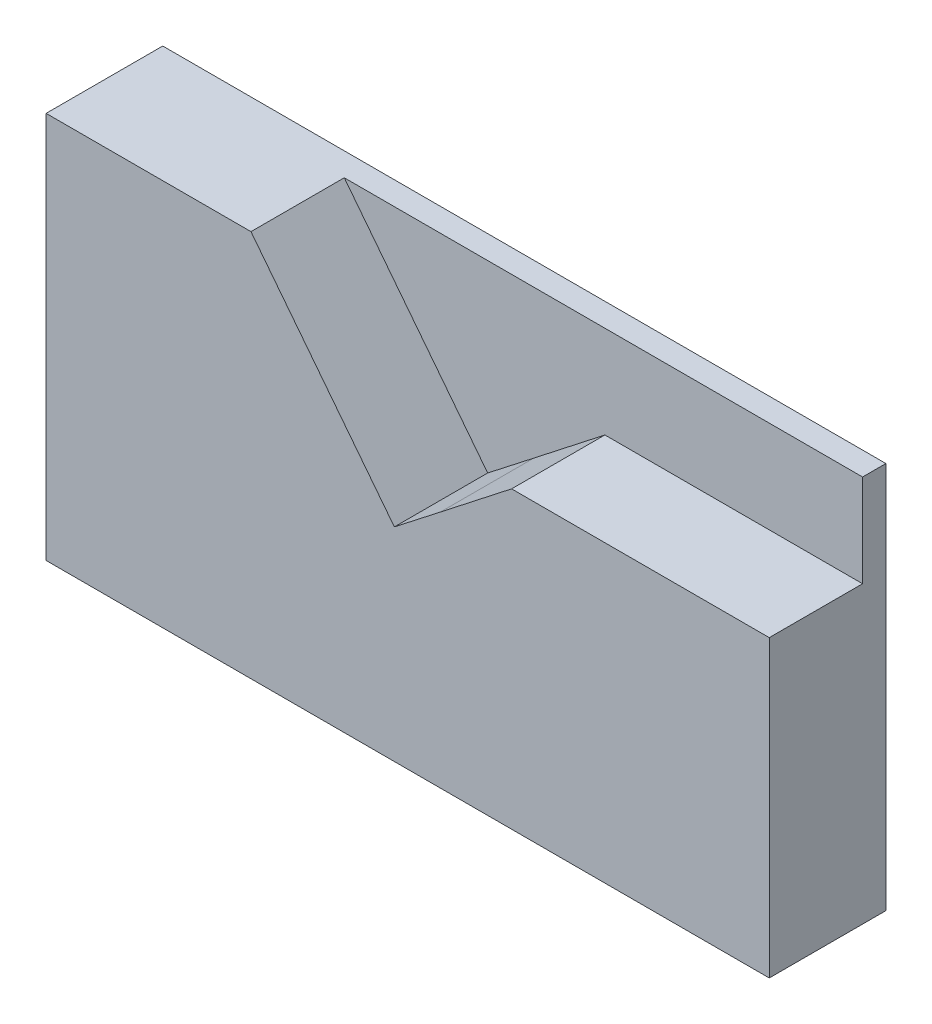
ISO-10303-21;
HEADER;
FILE_DESCRIPTION(('STEP AP214'),'2;1');
FILE_NAME('part.step','',(''),(''),'','','');
FILE_SCHEMA(('AUTOMOTIVE_DESIGN { 1 0 10303 214 1 1 1 1 }'));
ENDSEC;
DATA;
#1=APPLICATION_CONTEXT('core data for automotive mechanical design processes');
#2=APPLICATION_PROTOCOL_DEFINITION('international standard','automotive_design',2000,#1);
#3=PRODUCT_CONTEXT('',#1,'mechanical');
#4=PRODUCT('Part','Part','',(#3));
#5=PRODUCT_RELATED_PRODUCT_CATEGORY('part','',(#4));
#6=PRODUCT_DEFINITION_FORMATION('','',#4);
#7=PRODUCT_DEFINITION_CONTEXT('part definition',#1,'design');
#8=PRODUCT_DEFINITION('design','',#6,#7);
#9=PRODUCT_DEFINITION_SHAPE('','',#8);
#10=(LENGTH_UNIT() NAMED_UNIT(*) SI_UNIT(.MILLI.,.METRE.));
#11=(NAMED_UNIT(*) PLANE_ANGLE_UNIT() SI_UNIT($,.RADIAN.));
#12=(NAMED_UNIT(*) SI_UNIT($,.STERADIAN.) SOLID_ANGLE_UNIT());
#13=UNCERTAINTY_MEASURE_WITH_UNIT(LENGTH_MEASURE(1.E-05),#10,'distance_accuracy_value','');
#14=(GEOMETRIC_REPRESENTATION_CONTEXT(3) GLOBAL_UNCERTAINTY_ASSIGNED_CONTEXT((#13)) GLOBAL_UNIT_ASSIGNED_CONTEXT((#10,
#11,#12)) REPRESENTATION_CONTEXT('',''));
#15=CARTESIAN_POINT('',(0.,0.,0.));
#16=DIRECTION('',(0.,0.,1.));
#17=DIRECTION('',(1.,0.,0.));
#18=AXIS2_PLACEMENT_3D('',#15,#16,#17);
#19=CARTESIAN_POINT('',(0.,0.,6.35));
#20=DIRECTION('',(-1.,0.,0.));
#21=DIRECTION('',(0.,0.,1.));
#22=AXIS2_PLACEMENT_3D('',#19,#20,#21);
#23=PLANE('',#22);
#24=DIRECTION('',(0.,1.,0.));
#25=VECTOR('',#24,1.);
#26=CARTESIAN_POINT('',(0.,-44.6686440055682,1.27));
#27=LINE('',#26,#25);
#28=CARTESIAN_POINT('',(0.,16.048569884,1.27));
#29=VERTEX_POINT('',#28);
#30=CARTESIAN_POINT('',(0.,21.082,1.27));
#31=VERTEX_POINT('',#30);
#32=EDGE_CURVE('E132',#29,#31,#27,.T.);
#33=ORIENTED_EDGE('',*,*,#32,.F.);
#34=DIRECTION('',(0.,0.,1.));
#35=VECTOR('',#34,1.);
#36=CARTESIAN_POINT('',(0.,16.048569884,1.27));
#37=LINE('',#36,#35);
#38=CARTESIAN_POINT('',(0.,16.048569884,6.35));
#39=VERTEX_POINT('',#38);
#40=EDGE_CURVE('E109',#29,#39,#37,.T.);
#41=ORIENTED_EDGE('',*,*,#40,.T.);
#42=DIRECTION('',(0.,1.,0.));
#43=VECTOR('',#42,1.);
#44=CARTESIAN_POINT('',(0.,0.,6.35));
#45=LINE('',#44,#43);
#46=CARTESIAN_POINT('',(0.,0.,6.35));
#47=VERTEX_POINT('',#46);
#48=EDGE_CURVE('E119',#47,#39,#45,.T.);
#49=ORIENTED_EDGE('',*,*,#48,.F.);
#50=DIRECTION('',(0.,0.,-1.));
#51=VECTOR('',#50,1.);
#52=CARTESIAN_POINT('',(0.,0.,6.35));
#53=LINE('',#52,#51);
#54=CARTESIAN_POINT('',(0.,0.,0.));
#55=VERTEX_POINT('',#54);
#56=EDGE_CURVE('E160',#47,#55,#53,.T.);
#57=ORIENTED_EDGE('',*,*,#56,.T.);
#58=DIRECTION('',(0.,1.,0.));
#59=VECTOR('',#58,1.);
#60=CARTESIAN_POINT('',(0.,0.,0.));
#61=LINE('',#60,#59);
#62=CARTESIAN_POINT('',(0.,21.082,0.));
#63=VERTEX_POINT('',#62);
#64=EDGE_CURVE('E141',#55,#63,#61,.T.);
#65=ORIENTED_EDGE('',*,*,#64,.T.);
#66=DIRECTION('',(0.,0.,-1.));
#67=VECTOR('',#66,1.);
#68=CARTESIAN_POINT('',(0.,21.082,6.35));
#69=LINE('',#68,#67);
#70=EDGE_CURVE('E11',#31,#63,#69,.T.);
#71=ORIENTED_EDGE('',*,*,#70,.F.);
#72=EDGE_LOOP('',(#33,#41,#49,#57,#65,#71));
#73=FACE_BOUND('',#72,.T.);
#74=ADVANCED_FACE('F29',(#73),#23,.F.);
#75=CARTESIAN_POINT('',(0.,21.082,6.35));
#76=DIRECTION('',(0.,-1.,0.));
#77=DIRECTION('',(1.,0.,0.));
#78=AXIS2_PLACEMENT_3D('',#75,#76,#77);
#79=PLANE('',#78);
#80=DIRECTION('',(-1.,0.,0.));
#81=VECTOR('',#80,1.);
#82=CARTESIAN_POINT('',(0.,21.082,6.35));
#83=LINE('',#82,#81);
#84=CARTESIAN_POINT('',(-28.216693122,21.082,6.35));
#85=VERTEX_POINT('',#84);
#86=CARTESIAN_POINT('',(-39.37,21.082,6.35));
#87=VERTEX_POINT('',#86);
#88=EDGE_CURVE('E155',#85,#87,#83,.T.);
#89=ORIENTED_EDGE('',*,*,#88,.F.);
#90=DIRECTION('',(0.,0.,1.));
#91=VECTOR('',#90,1.);
#92=CARTESIAN_POINT('',(-28.216693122,21.082,1.27));
#93=LINE('',#92,#91);
#94=CARTESIAN_POINT('',(-28.216693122,21.082,1.27));
#95=VERTEX_POINT('',#94);
#96=EDGE_CURVE('E142',#95,#85,#93,.T.);
#97=ORIENTED_EDGE('',*,*,#96,.F.);
#98=DIRECTION('',(-1.,0.,0.));
#99=VECTOR('',#98,1.);
#100=CARTESIAN_POINT('',(-5.57665343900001,21.082,1.27));
#101=LINE('',#100,#99);
#102=EDGE_CURVE('E134',#31,#95,#101,.T.);
#103=ORIENTED_EDGE('',*,*,#102,.F.);
#104=ORIENTED_EDGE('',*,*,#70,.T.);
#105=DIRECTION('',(-1.,0.,0.));
#106=VECTOR('',#105,1.);
#107=CARTESIAN_POINT('',(0.,21.082,0.));
#108=LINE('',#107,#106);
#109=CARTESIAN_POINT('',(-39.37,21.082,0.));
#110=VERTEX_POINT('',#109);
#111=EDGE_CURVE('E148',#63,#110,#108,.T.);
#112=ORIENTED_EDGE('',*,*,#111,.T.);
#113=DIRECTION('',(0.,0.,-1.));
#114=VECTOR('',#113,1.);
#115=CARTESIAN_POINT('',(-39.37,21.082,6.35));
#116=LINE('',#115,#114);
#117=EDGE_CURVE('E36',#87,#110,#116,.T.);
#118=ORIENTED_EDGE('',*,*,#117,.F.);
#119=EDGE_LOOP('',(#89,#97,#103,#104,#112,#118));
#120=FACE_BOUND('',#119,.T.);
#121=ADVANCED_FACE('F193',(#120),#79,.F.);
#122=CARTESIAN_POINT('',(-39.37,0.,6.35));
#123=DIRECTION('',(1.,0.,0.));
#124=DIRECTION('',(0.,0.,-1.));
#125=AXIS2_PLACEMENT_3D('',#122,#123,#124);
#126=PLANE('',#125);
#127=DIRECTION('',(0.,-1.,0.));
#128=VECTOR('',#127,1.);
#129=CARTESIAN_POINT('',(-39.37,0.,0.));
#130=LINE('',#129,#128);
#131=CARTESIAN_POINT('',(-39.37,0.,0.));
#132=VERTEX_POINT('',#131);
#133=EDGE_CURVE('E150',#110,#132,#130,.T.);
#134=ORIENTED_EDGE('',*,*,#133,.T.);
#135=DIRECTION('',(0.,0.,-1.));
#136=VECTOR('',#135,1.);
#137=CARTESIAN_POINT('',(-39.37,0.,6.35));
#138=LINE('',#137,#136);
#139=CARTESIAN_POINT('',(-39.37,0.,6.35));
#140=VERTEX_POINT('',#139);
#141=EDGE_CURVE('E163',#140,#132,#138,.T.);
#142=ORIENTED_EDGE('',*,*,#141,.F.);
#143=DIRECTION('',(0.,-1.,0.));
#144=VECTOR('',#143,1.);
#145=CARTESIAN_POINT('',(-39.37,0.,6.35));
#146=LINE('',#145,#144);
#147=EDGE_CURVE('E157',#87,#140,#146,.T.);
#148=ORIENTED_EDGE('',*,*,#147,.F.);
#149=ORIENTED_EDGE('',*,*,#117,.T.);
#150=EDGE_LOOP('',(#134,#142,#148,#149));
#151=FACE_BOUND('',#150,.T.);
#152=ADVANCED_FACE('F170',(#151),#126,.F.);
#153=CARTESIAN_POINT('',(0.,0.,6.35));
#154=DIRECTION('',(0.,1.,0.));
#155=DIRECTION('',(-1.,0.,0.));
#156=AXIS2_PLACEMENT_3D('',#153,#154,#155);
#157=PLANE('',#156);
#158=DIRECTION('',(1.,0.,0.));
#159=VECTOR('',#158,1.);
#160=CARTESIAN_POINT('',(0.,0.,0.));
#161=LINE('',#160,#159);
#162=EDGE_CURVE('E152',#132,#55,#161,.T.);
#163=ORIENTED_EDGE('',*,*,#162,.T.);
#164=ORIENTED_EDGE('',*,*,#56,.F.);
#165=DIRECTION('',(1.,0.,0.));
#166=VECTOR('',#165,1.);
#167=CARTESIAN_POINT('',(0.,0.,6.35));
#168=LINE('',#167,#166);
#169=EDGE_CURVE('E51',#140,#47,#168,.T.);
#170=ORIENTED_EDGE('',*,*,#169,.F.);
#171=ORIENTED_EDGE('',*,*,#141,.T.);
#172=EDGE_LOOP('',(#163,#164,#170,#171));
#173=FACE_BOUND('',#172,.T.);
#174=ADVANCED_FACE('F180',(#173),#157,.F.);
#175=CARTESIAN_POINT('',(0.,0.,6.35));
#176=DIRECTION('',(0.,0.,1.));
#177=DIRECTION('',(1.,0.,0.));
#178=AXIS2_PLACEMENT_3D('',#175,#176,#177);
#179=PLANE('',#178);
#180=DIRECTION('',(0.614667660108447,-0.788786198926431,0.));
#181=VECTOR('',#180,1.);
#182=CARTESIAN_POINT('',(12.2157157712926,-30.8038046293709,6.35));
#183=LINE('',#182,#181);
#184=CARTESIAN_POINT('',(-20.4104138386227,11.0644152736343,6.35));
#185=VERTEX_POINT('',#184);
#186=EDGE_CURVE('E120',#85,#185,#183,.T.);
#187=ORIENTED_EDGE('',*,*,#186,.F.);
#188=ORIENTED_EDGE('',*,*,#88,.T.);
#189=ORIENTED_EDGE('',*,*,#147,.T.);
#190=ORIENTED_EDGE('',*,*,#169,.T.);
#191=ORIENTED_EDGE('',*,*,#48,.T.);
#192=DIRECTION('',(1.,0.,0.));
#193=VECTOR('',#192,1.);
#194=CARTESIAN_POINT('',(-5.576653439,16.048569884,6.35));
#195=LINE('',#194,#193);
#196=CARTESIAN_POINT('',(-14.027760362,16.048569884,6.35));
#197=VERTEX_POINT('',#196);
#198=EDGE_CURVE('E102',#197,#39,#195,.T.);
#199=ORIENTED_EDGE('',*,*,#198,.F.);
#200=DIRECTION('',(0.787758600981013,0.615984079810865,0.));
#201=VECTOR('',#200,1.);
#202=CARTESIAN_POINT('',(-38.2461420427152,-2.88887813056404,6.35));
#203=LINE('',#202,#201);
#204=CARTESIAN_POINT('',(-17.9060176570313,13.0159850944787,6.35));
#205=VERTEX_POINT('',#204);
#206=EDGE_CURVE('E113',#205,#197,#203,.T.);
#207=ORIENTED_EDGE('',*,*,#206,.F.);
#208=DIRECTION('',(0.788786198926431,0.614667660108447,0.));
#209=VECTOR('',#208,1.);
#210=CARTESIAN_POINT('',(-38.2027830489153,-2.80042410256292,6.35));
#211=LINE('',#210,#209);
#212=EDGE_CURVE('E43',#185,#205,#211,.T.);
#213=ORIENTED_EDGE('',*,*,#212,.F.);
#214=EDGE_LOOP('',(#187,#188,#189,#190,#191,#199,#207,#213));
#215=FACE_BOUND('',#214,.T.);
#216=ADVANCED_FACE('F117',(#215),#179,.T.);
#217=CARTESIAN_POINT('',(0.,0.,0.));
#218=DIRECTION('',(0.,0.,1.));
#219=DIRECTION('',(1.,0.,0.));
#220=AXIS2_PLACEMENT_3D('',#217,#218,#219);
#221=PLANE('',#220);
#222=ORIENTED_EDGE('',*,*,#64,.F.);
#223=ORIENTED_EDGE('',*,*,#162,.F.);
#224=ORIENTED_EDGE('',*,*,#133,.F.);
#225=ORIENTED_EDGE('',*,*,#111,.F.);
#226=EDGE_LOOP('',(#222,#223,#224,#225));
#227=FACE_BOUND('',#226,.T.);
#228=ADVANCED_FACE('F178',(#227),#221,.F.);
#229=CARTESIAN_POINT('',(-38.2027830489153,-2.80042410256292,1.27));
#230=DIRECTION('',(0.614667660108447,-0.78878619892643,0.));
#231=DIRECTION('',(0.788786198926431,0.614667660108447,0.));
#232=AXIS2_PLACEMENT_3D('',#229,#230,#231);
#233=PLANE('',#232);
#234=ORIENTED_EDGE('',*,*,#212,.T.);
#235=DIRECTION('',(0.,0.,1.));
#236=VECTOR('',#235,1.);
#237=CARTESIAN_POINT('',(-17.9060176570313,13.0159850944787,1.27));
#238=LINE('',#237,#236);
#239=CARTESIAN_POINT('',(-17.9060176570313,13.0159850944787,1.27));
#240=VERTEX_POINT('',#239);
#241=EDGE_CURVE('E110',#240,#205,#238,.T.);
#242=ORIENTED_EDGE('',*,*,#241,.F.);
#243=DIRECTION('',(0.788786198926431,0.614667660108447,0.));
#244=VECTOR('',#243,1.);
#245=CARTESIAN_POINT('',(-38.2027830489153,-2.80042410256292,1.27));
#246=LINE('',#245,#244);
#247=CARTESIAN_POINT('',(-20.4104138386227,11.0644152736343,1.27));
#248=VERTEX_POINT('',#247);
#249=EDGE_CURVE('E123',#248,#240,#246,.T.);
#250=ORIENTED_EDGE('',*,*,#249,.F.);
#251=DIRECTION('',(0.,0.,1.));
#252=VECTOR('',#251,1.);
#253=CARTESIAN_POINT('',(-20.4104138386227,11.0644152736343,1.27));
#254=LINE('',#253,#252);
#255=EDGE_CURVE('E139',#248,#185,#254,.T.);
#256=ORIENTED_EDGE('',*,*,#255,.T.);
#257=EDGE_LOOP('',(#234,#242,#250,#256));
#258=FACE_BOUND('',#257,.T.);
#259=ADVANCED_FACE('F189',(#258),#233,.F.);
#260=CARTESIAN_POINT('',(12.2157157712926,-30.8038046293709,1.27));
#261=DIRECTION('',(-0.788786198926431,-0.614667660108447,0.));
#262=DIRECTION('',(0.614667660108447,-0.788786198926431,0.));
#263=AXIS2_PLACEMENT_3D('',#260,#261,#262);
#264=PLANE('',#263);
#265=ORIENTED_EDGE('',*,*,#186,.T.);
#266=ORIENTED_EDGE('',*,*,#255,.F.);
#267=DIRECTION('',(0.614667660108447,-0.788786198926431,0.));
#268=VECTOR('',#267,1.);
#269=CARTESIAN_POINT('',(12.2157157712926,-30.8038046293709,1.27));
#270=LINE('',#269,#268);
#271=EDGE_CURVE('E136',#95,#248,#270,.T.);
#272=ORIENTED_EDGE('',*,*,#271,.F.);
#273=ORIENTED_EDGE('',*,*,#96,.T.);
#274=EDGE_LOOP('',(#265,#266,#272,#273));
#275=FACE_BOUND('',#274,.T.);
#276=ADVANCED_FACE('F191',(#275),#264,.F.);
#277=CARTESIAN_POINT('',(-5.576653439,16.048569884,1.27));
#278=DIRECTION('',(0.,-1.,0.));
#279=DIRECTION('',(0.,0.,-1.));
#280=AXIS2_PLACEMENT_3D('',#277,#278,#279);
#281=PLANE('',#280);
#282=ORIENTED_EDGE('',*,*,#198,.T.);
#283=ORIENTED_EDGE('',*,*,#40,.F.);
#284=DIRECTION('',(1.,0.,0.));
#285=VECTOR('',#284,1.);
#286=CARTESIAN_POINT('',(-5.576653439,16.048569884,1.27));
#287=LINE('',#286,#285);
#288=CARTESIAN_POINT('',(-14.027760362,16.048569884,1.27));
#289=VERTEX_POINT('',#288);
#290=EDGE_CURVE('E105',#289,#29,#287,.T.);
#291=ORIENTED_EDGE('',*,*,#290,.F.);
#292=DIRECTION('',(0.,0.,1.));
#293=VECTOR('',#292,1.);
#294=CARTESIAN_POINT('',(-14.027760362,16.048569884,1.27));
#295=LINE('',#294,#293);
#296=EDGE_CURVE('E98',#289,#197,#295,.T.);
#297=ORIENTED_EDGE('',*,*,#296,.T.);
#298=EDGE_LOOP('',(#282,#283,#291,#297));
#299=FACE_BOUND('',#298,.T.);
#300=ADVANCED_FACE('F100',(#299),#281,.F.);
#301=CARTESIAN_POINT('',(-38.2461420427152,-2.88887813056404,1.27));
#302=DIRECTION('',(0.615984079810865,-0.787758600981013,0.));
#303=DIRECTION('',(0.787758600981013,0.615984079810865,0.));
#304=AXIS2_PLACEMENT_3D('',#301,#302,#303);
#305=PLANE('',#304);
#306=ORIENTED_EDGE('',*,*,#206,.T.);
#307=ORIENTED_EDGE('',*,*,#296,.F.);
#308=DIRECTION('',(0.787758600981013,0.615984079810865,0.));
#309=VECTOR('',#308,1.);
#310=CARTESIAN_POINT('',(-38.2461420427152,-2.88887813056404,1.27));
#311=LINE('',#310,#309);
#312=EDGE_CURVE('E129',#240,#289,#311,.T.);
#313=ORIENTED_EDGE('',*,*,#312,.F.);
#314=ORIENTED_EDGE('',*,*,#241,.T.);
#315=EDGE_LOOP('',(#306,#307,#313,#314));
#316=FACE_BOUND('',#315,.T.);
#317=ADVANCED_FACE('F114',(#316),#305,.F.);
#318=CARTESIAN_POINT('',(-5.576653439,-44.6686440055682,1.27));
#319=DIRECTION('',(0.,0.,1.));
#320=DIRECTION('',(1.,0.,0.));
#321=AXIS2_PLACEMENT_3D('',#318,#319,#320);
#322=PLANE('',#321);
#323=ORIENTED_EDGE('',*,*,#249,.T.);
#324=ORIENTED_EDGE('',*,*,#312,.T.);
#325=ORIENTED_EDGE('',*,*,#290,.T.);
#326=ORIENTED_EDGE('',*,*,#32,.T.);
#327=ORIENTED_EDGE('',*,*,#102,.T.);
#328=ORIENTED_EDGE('',*,*,#271,.T.);
#329=EDGE_LOOP('',(#323,#324,#325,#326,#327,#328));
#330=FACE_BOUND('',#329,.T.);
#331=ADVANCED_FACE('F185',(#330),#322,.T.);
#332=CLOSED_SHELL('',(#74,#121,#152,#174,#216,#228,#259,#276,#300,#317,#331));
#333=MANIFOLD_SOLID_BREP('B2',#332);
#334=ADVANCED_BREP_SHAPE_REPRESENTATION('',(#18,#333),#14);
#335=SHAPE_DEFINITION_REPRESENTATION(#9,#334);
ENDSEC;
END-ISO-10303-21;
